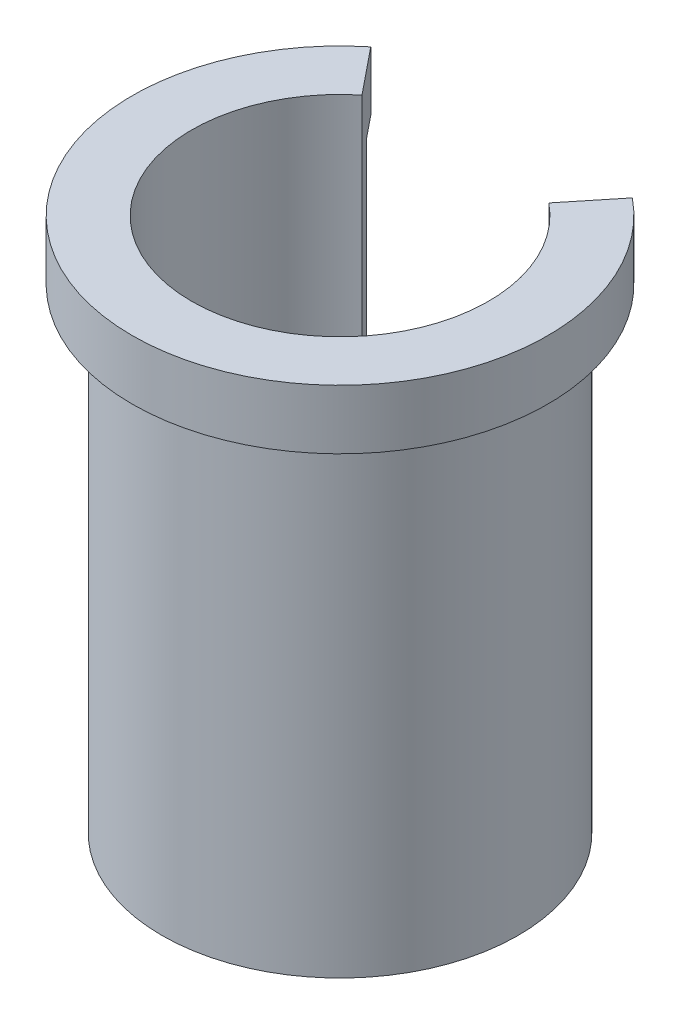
from build123d import *

# Parameters (mm, degrees)
SKETCH1_R      = 6
SKETCH1_R_2    = 5
EXTRUDE1_DEPTH = 18
EXTRUDE2_START = -2
SKETCH2_R      = 7
SKETCH2_R_2    = 5
EXTRUDE2_DEPTH = 2
EXTRUDE7_DEPTH = 21.542638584


with BuildPart() as part:
    # Sketch1 → Extrude1 (new body)
    with BuildSketch(Plane(origin=(0, 0, 0), x_dir=(1, 0, 0), z_dir=(0, 1, 0))):
        with Locations(Location((0, 0, 0), (0, 0, 270))):
            Circle(SKETCH1_R)
        with Locations(Location((0, 0, 0), (0, 0, 270))):
            Circle(SKETCH1_R_2, mode=Mode.SUBTRACT)
    extrude(amount=EXTRUDE1_DEPTH)

    # Sketch2 → Extrude2 (add)
    with BuildSketch(Plane(origin=(0, 18, 0), x_dir=(1, 0, 0), z_dir=(0, 1, 0)).offset(EXTRUDE2_START)):
        with Locations(Location((0, 0, 0), (0, 0, 270))):
            Circle(SKETCH2_R)
        with Locations(Location((0, 0, 0), (0, 0, 270))):
            Circle(SKETCH2_R_2, mode=Mode.SUBTRACT)
    extrude(amount=EXTRUDE2_DEPTH)

    # Sketch3 → Extrude7 (cut, through all)
    with BuildSketch(Plane(origin=(0, 18, 0), x_dir=(1, 0, 0), z_dir=(0, 1, 0))):
        with BuildLine():
            Line((4.405242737, 5.44002173), (3.146601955, 3.885729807))
            ThreePointArc((3.146601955, 3.885729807), (0, 5), (-3.146601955, 3.885729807))
            Line((-3.146601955, 3.885729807), (-4.405242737, 5.44002173))
            ThreePointArc((-4.405242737, 5.44002173), (0, 7), (4.405242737, 5.44002173))
        make_face()
    extrude(amount=-EXTRUDE7_DEPTH, mode=Mode.SUBTRACT)


solid = part.part
